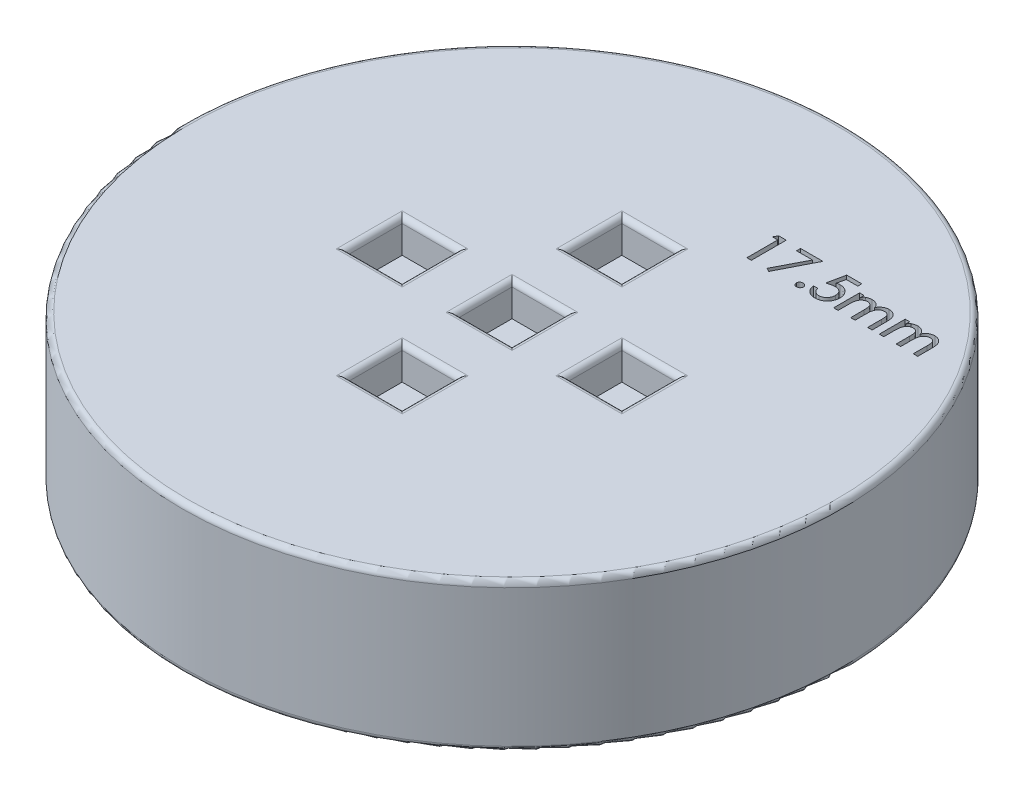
from build123d import *

# Parameters (mm, degrees)
SKETCH1_R           = 30
BOSS_EXTRUDE1_DEPTH = 13.5
SKETCH2_W           = 5
SKETCH2_H           = 5
CUT_EXTRUDE1_DEPTH  = 3
FILLET1_R           = 0.5
SKETCH4_W           = 5
SKETCH4_H           = 5
CUT_EXTRUDE2_DEPTH  = 3
FILLET2_R           = 0.5
FILLET3_R           = 0.5
CUT_EXTRUDE3_DEPTH  = 2


with BuildPart() as part:
    # Sketch1 → Boss-Extrude1 (new body)
    with BuildSketch(Plane(origin=(0, 0, 0), x_dir=(1, 0, 0), z_dir=(0, 1, 0))):
        with Locations(Location((0, 0, 0), (0, 0, 270))):
            Circle(SKETCH1_R)
    extrude(amount=BOSS_EXTRUDE1_DEPTH)

    # Sketch2 → Cut-Extrude1 (cut)
    with BuildSketch(Plane(origin=(0, 13.5, 0), x_dir=(1, 0, 0), z_dir=(0, 1, 0))):
        with Locations((0, -10)):
            Rectangle(SKETCH2_W, SKETCH2_H)
        with Locations((-10, 0)):
            Rectangle(SKETCH2_W, SKETCH2_H)
        Rectangle(SKETCH2_W, SKETCH2_H)
        with Locations((0, 10)):
            Rectangle(SKETCH2_W, SKETCH2_H)
        with Locations((10, 0)):
            Rectangle(SKETCH2_W, SKETCH2_H)
    extrude(amount=-CUT_EXTRUDE1_DEPTH, mode=Mode.SUBTRACT)

    # Fillet1
    fillet1_edges = [part.edges().sort_by_distance(p)[0] for p in [
        (2.5, 13.5, 0),
        (0, 13.5, 2.5),
        (-12.5, 13.5, 0),
        (-10, 13.5, 2.5),
        (-7.5, 13.5, 0),
        (-10, 13.5, -2.5),
    ]]
    fillet(fillet1_edges, radius=FILLET1_R)

    # Sketch4 → Cut-Extrude2 (cut)
    with BuildSketch(Plane(origin=(0, 0, 0), x_dir=(-1, 0, 0), z_dir=(0, -1, 0))):
        Rectangle(SKETCH4_W, SKETCH4_H)
        with Locations((0, -10)):
            Rectangle(SKETCH4_W, SKETCH4_H)
        with Locations((10, 0)):
            Rectangle(SKETCH4_W, SKETCH4_H)
        with Locations((-10, 0)):
            Rectangle(SKETCH4_W, SKETCH4_H)
        with Locations((0, 10)):
            Rectangle(SKETCH4_W, SKETCH4_H)
    extrude(amount=-CUT_EXTRUDE2_DEPTH, mode=Mode.SUBTRACT)

    # Fillet2
    fillet2_edges = [part.edges().sort_by_distance(p)[0] for p in [
        (-2.5, 0, 0),
        (0, 0, -2.5),
        (2.5, 0, 0),
        (0, 0, 2.5),
        (-2.5, 0, 10),
        (0, 0, 7.5),
        (2.5, 0, 10),
        (0, 0, 12.5),
        (-12.5, 0, 0),
        (-10, 0, -2.5),
        (-7.5, 0, 0),
        (-10, 0, 2.5),
        (7.5, 0, 0),
        (10, 0, -2.5),
        (12.5, 0, 0),
        (10, 0, 2.5),
        (2.5, 0, -10),
        (0, 0, -7.5),
        (-2.5, 0, -10),
        (0, 0, -12.5),
        (0, 0, -30),
    ]]
    fillet(fillet2_edges, radius=FILLET2_R)

    # Fillet3
    fillet3_edges = [part.edges().sort_by_distance(p)[0] for p in [
        (0, 13.5, -30),
        (0, 13.5, 7.5),
        (-2.5, 13.5, 10),
        (0, 13.5, 12.5),
        (2.5, 13.5, 10),
        (-2.5, 13.5, 0.25),
        (0.25, 13.5, -2.5),
        (0, 13.5, -12.5),
        (-2.5, 13.5, -10),
        (0, 13.5, -7.5),
        (2.5, 13.5, -10),
        (10, 13.5, 2.5),
        (12.5, 13.5, 0),
        (10, 13.5, -2.5),
        (7.5, 13.5, 0),
    ]]
    fillet(fillet3_edges, radius=FILLET3_R)

    # Sketch5 → Cut-Extrude3 (cut)
    with BuildSketch(Plane(origin=(0, 13.5, 0), x_dir=(1, 0, 0), z_dir=(0, 1, 0))):
        Polygon((6.099448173, 18.173639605), (6.790163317, 18.173639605), (6.790163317, 14.998639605), (6.383112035, 14.998639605), (6.383112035, 17.807293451), (5.894650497, 17.807293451), align=None)
        Polygon((8.09272742, 18.173639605), (10.12798383, 18.173639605), (8.462889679, 14.917229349), (8.132160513, 15.075597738), (9.545391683, 17.807293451), (8.09272742, 17.807293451), align=None)
        with BuildLine():
            add(Edge.make_bspline(
                [(10.92173383, 15.5685114), (10.946446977, 15.567565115), (10.994036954, 15.565742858), (11.061612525, 15.547447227), (11.121793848, 15.517056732), (11.172232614, 15.474830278), (11.214524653, 15.427202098), (11.244554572, 15.374931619), (11.264889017, 15.320231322), (11.266779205, 15.28226752), (11.26772742, 15.263222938)],
                knots=[0, 0, 0, 0, 1.15701891, 2.228065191, 3.255424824, 4.294461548, 5.295444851, 6.226722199, 7.110433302, 8, 8, 8, 8], degree=3))
            add(Edge.make_bspline(
                [(11.26772742, 15.263222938), (11.266693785, 15.244416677), (11.264625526, 15.206786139), (11.245402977, 15.151996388), (11.21490795, 15.099844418), (11.173097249, 15.051675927), (11.122577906, 15.009243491), (11.061790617, 14.9798333), (10.994361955, 14.960520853), (10.94646884, 14.958815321), (10.92173383, 14.957934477)],
                knots=[0, 0, 0, 0, 0.879435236, 1.759712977, 2.690738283, 3.698978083, 4.737733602, 5.760330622, 6.843294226, 8, 8, 8, 8], degree=3))
            add(Edge.make_bspline(
                [(10.92173383, 14.957934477), (10.901271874, 14.959043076), (10.861133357, 14.961217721), (10.803311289, 14.978178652), (10.750852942, 15.007089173), (10.704117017, 15.045591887), (10.665379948, 15.092442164), (10.636995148, 15.145144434), (10.619614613, 15.202790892), (10.617519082, 15.242749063), (10.616445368, 15.263222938)],
                knots=[0, 0, 0, 0, 1.022542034, 2.005835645, 2.98339371, 4.000421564, 5.017449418, 6.004339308, 6.977457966, 8, 8, 8, 8], degree=3))
            add(Edge.make_bspline(
                [(10.616445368, 15.263222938), (10.617533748, 15.283901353), (10.619658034, 15.32426124), (10.63672122, 15.382255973), (10.665403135, 15.434692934), (10.704337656, 15.480855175), (10.750924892, 15.519600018), (10.803662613, 15.547955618), (10.861299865, 15.565343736), (10.901259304, 15.567438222), (10.92173383, 15.5685114)],
                knots=[0, 0, 0, 0, 1.03279153, 2.015790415, 2.993055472, 4.001620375, 5.018343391, 6.004937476, 6.977764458, 8, 8, 8, 8], degree=3))
        make_face()
        with BuildLine():
            Line((13.669329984, 18.173639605), (13.669329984, 17.807293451))
            Line((13.669329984, 17.807293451), (12.626261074, 17.807293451))
            Line((12.626261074, 17.807293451), (12.455808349, 17.054884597))
            add(Edge.make_bspline(
                [(12.455808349, 17.054884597), (12.475693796, 17.064468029), (12.516618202, 17.084190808), (12.585037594, 17.101375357), (12.659321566, 17.113466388), (12.711217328, 17.114676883), (12.738200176, 17.115306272)],
                knots=[0, 0, 0, 0, 0.906577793, 1.865744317, 2.890308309, 4, 4, 4, 4], degree=3))
            add(Edge.make_bspline(
                [(12.738200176, 17.115306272), (12.776416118, 17.114606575), (12.851446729, 17.113232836), (12.960797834, 17.097881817), (13.064999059, 17.074883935), (13.163193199, 17.040575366), (13.256501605, 16.998339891), (13.343911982, 16.945488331), (13.425333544, 16.88291722), (13.500657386, 16.811691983), (13.56930848, 16.734110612), (13.628270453, 16.650330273), (13.679380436, 16.56279847), (13.719892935, 16.470002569), (13.751902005, 16.372902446), (13.77466605, 16.271092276), (13.789137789, 16.164877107), (13.790669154, 16.092425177), (13.791445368, 16.055700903)],
                knots=[0, 0, 0, 0, 1.094894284, 2.149641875, 3.159658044, 4.149576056, 5.125966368, 6.091225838, 7.071072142, 8.064343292, 9.05924964, 10.03573454, 10.996966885, 11.96032995, 12.932910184, 13.923798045, 14.947619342, 16, 16, 16, 16], degree=3))
            add(Edge.make_bspline(
                [(13.791445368, 16.055700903), (13.790848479, 16.030038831), (13.789667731, 15.979274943), (13.783514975, 15.90379233), (13.771770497, 15.829937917), (13.756176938, 15.757141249), (13.734690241, 15.686026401), (13.710230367, 15.61564793), (13.68017946, 15.547127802), (13.645871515, 15.480494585), (13.607807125, 15.416235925), (13.565896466, 15.355131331), (13.520043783, 15.297669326), (13.470086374, 15.24433086), (13.417389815, 15.193744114), (13.360579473, 15.147229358), (13.299816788, 15.104591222), (13.235968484, 15.06536361), (13.169065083, 15.029924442), (13.098713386, 15.00058153), (13.026659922, 14.973920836), (12.951122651, 14.953958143), (12.873525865, 14.937160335), (12.792938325, 14.926012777), (12.709924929, 14.918744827), (12.65362574, 14.917740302), (12.624989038, 14.917229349)],
                knots=[0, 0, 0, 0, 1.012275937, 2.002451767, 2.98397589, 3.959820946, 4.936095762, 5.911940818, 6.896771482, 7.884012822, 8.866284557, 9.840372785, 10.804070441, 11.762530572, 12.720625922, 13.68308951, 14.655094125, 15.646011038, 16.637104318, 17.63729087, 18.650257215, 19.66446511, 20.715636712, 21.77986274, 22.870722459, 24, 24, 24, 24], degree=3))
            add(Edge.make_bspline(
                [(12.624989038, 14.917229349), (12.592735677, 14.918003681), (12.529106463, 14.91953128), (12.435653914, 14.930366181), (12.346001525, 14.948749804), (12.260529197, 14.975065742), (12.178601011, 15.008073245), (12.100915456, 15.048905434), (12.027170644, 15.097195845), (11.957271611, 15.152023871), (11.893520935, 15.214568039), (11.834756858, 15.281898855), (11.784689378, 15.356495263), (11.740645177, 15.436298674), (11.702801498, 15.521958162), (11.672694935, 15.613636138), (11.648621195, 15.710985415), (11.63899918, 15.778288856), (11.634073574, 15.812742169)],
                knots=[0, 0, 0, 0, 1.049569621, 2.070583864, 3.057046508, 4.023914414, 4.977170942, 5.927726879, 6.875021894, 7.842677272, 8.813672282, 9.777581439, 10.74592533, 11.731059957, 12.74126976, 13.788569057, 14.867946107, 16, 16, 16, 16], degree=3))
            Line((11.634073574, 15.812742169), (12.031584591, 15.812742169))
            add(Edge.make_bspline(
                [(12.031584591, 15.812742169), (12.039150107, 15.779468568), (12.053352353, 15.71700622), (12.083862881, 15.631897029), (12.116563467, 15.559510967), (12.156559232, 15.500311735), (12.202464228, 15.451718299), (12.253415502, 15.409537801), (12.309391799, 15.371700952), (12.371015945, 15.340293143), (12.435943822, 15.314847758), (12.50340608, 15.297088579), (12.572040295, 15.285921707), (12.61837541, 15.284357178), (12.641525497, 15.283575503)],
                knots=[0, 0, 0, 0, 1.385459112, 2.600831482, 3.66841355, 4.605180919, 5.48910649, 6.376050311, 7.288896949, 8.229144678, 9.181161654, 10.117453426, 11.059436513, 12, 12, 12, 12], degree=3))
            add(Edge.make_bspline(
                [(12.641525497, 15.283575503), (12.666568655, 15.284416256), (12.716011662, 15.286076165), (12.788849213, 15.296013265), (12.858508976, 15.314394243), (12.925996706, 15.338219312), (12.990133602, 15.370670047), (13.052493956, 15.408560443), (13.110803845, 15.455088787), (13.166692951, 15.506822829), (13.217881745, 15.564126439), (13.262454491, 15.626040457), (13.300476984, 15.691321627), (13.330777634, 15.760404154), (13.355369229, 15.832655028), (13.372272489, 15.908567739), (13.382818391, 15.987983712), (13.383861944, 16.042098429), (13.384394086, 16.069693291)],
                knots=[0, 0, 0, 0, 0.99750234, 1.969380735, 2.919490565, 3.862219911, 4.813679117, 5.776605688, 6.762898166, 7.778387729, 8.806918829, 9.816812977, 10.811632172, 11.809420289, 12.815921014, 13.846113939, 14.901663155, 16, 16, 16, 16], degree=3))
            add(Edge.make_bspline(
                [(13.384394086, 16.069693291), (13.383761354, 16.094314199), (13.382518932, 16.142659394), (13.373417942, 16.213317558), (13.358981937, 16.280716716), (13.338005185, 16.34422327), (13.311040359, 16.404188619), (13.27788197, 16.460229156), (13.238631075, 16.512656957), (13.194489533, 16.561641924), (13.144520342, 16.605410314), (13.090868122, 16.644582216), (13.031903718, 16.676263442), (12.969753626, 16.703374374), (12.90298025, 16.723188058), (12.832779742, 16.739153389), (12.757873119, 16.746823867), (12.706623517, 16.748235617), (12.680322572, 16.748960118)],
                knots=[0, 0, 0, 0, 1.071512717, 2.104004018, 3.095982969, 4.067795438, 5.009520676, 5.952827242, 6.895998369, 7.856350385, 8.817411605, 9.782937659, 10.74115891, 11.725120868, 12.729302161, 13.768330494, 14.854722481, 16, 16, 16, 16], degree=3))
            add(Edge.make_bspline(
                [(12.680322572, 16.748960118), (12.657831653, 16.748420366), (12.610614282, 16.747287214), (12.536727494, 16.739093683), (12.456324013, 16.726206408), (12.36953098, 16.7083826), (12.276264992, 16.685161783), (12.176412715, 16.657023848), (12.069863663, 16.624190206), (11.997167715, 16.59907765), (11.959714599, 16.586139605)],
                knots=[0, 0, 0, 0, 0.727614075, 1.527550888, 2.402655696, 3.361819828, 4.39328773, 5.511706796, 6.718025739, 8, 8, 8, 8], degree=3))
            Line((11.959714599, 16.586139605), (12.292987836, 18.173639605))
            Line((12.292987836, 18.173639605), (13.669329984, 18.173639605))
        make_face()
        with BuildLine():
            Line((14.279906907, 17.359537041), (14.686958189, 17.359537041))
            Line((14.686958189, 17.359537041), (14.686958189, 16.963298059))
            add(Edge.make_bspline(
                [(14.686958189, 16.963298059), (14.690867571, 16.980348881), (14.698495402, 17.013617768), (14.715292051, 17.061093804), (14.735811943, 17.104995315), (14.759166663, 17.146371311), (14.787546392, 17.183616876), (14.818589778, 17.218617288), (14.854529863, 17.249026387), (14.880567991, 17.266695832), (14.893663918, 17.275582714)],
                knots=[0, 0, 0, 0, 1.08898891, 2.124791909, 3.129224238, 4.105481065, 5.077441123, 6.040388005, 7.014409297, 8, 8, 8, 8], degree=3))
            add(Edge.make_bspline(
                [(14.893663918, 17.275582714), (14.933082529, 17.294892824), (15.010913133, 17.333019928), (15.134010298, 17.37089318), (15.258549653, 17.396126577), (15.342568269, 17.398868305), (15.384669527, 17.400242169)],
                knots=[0, 0, 0, 0, 1.028471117, 2.030678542, 3.013184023, 4, 4, 4, 4], degree=3))
            add(Edge.make_bspline(
                [(15.384669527, 17.400242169), (15.41567654, 17.399452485), (15.477165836, 17.39788648), (15.568212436, 17.383286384), (15.656637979, 17.35981737), (15.741608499, 17.327426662), (15.820877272, 17.287683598), (15.893251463, 17.242775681), (15.956958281, 17.191866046), (16.012816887, 17.136124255), (16.059231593, 17.073629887), (16.095832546, 17.005198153), (16.121798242, 16.929976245), (16.1306343, 16.877186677), (16.135170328, 16.850086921)],
                knots=[0, 0, 0, 0, 1.099015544, 2.179432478, 3.260947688, 4.338981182, 5.398181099, 6.40160478, 7.353922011, 8.284349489, 9.192639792, 10.104191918, 11.026778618, 12, 12, 12, 12], degree=3))
            add(Edge.make_bspline(
                [(16.135170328, 16.850086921), (16.142517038, 16.870971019), (16.157044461, 16.912267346), (16.183609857, 16.971761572), (16.215790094, 17.027292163), (16.252181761, 17.079601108), (16.292793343, 17.12901041), (16.339073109, 17.173800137), (16.388649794, 17.216469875), (16.44332119, 17.253873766), (16.500189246, 17.288185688), (16.558867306, 17.318098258), (16.618471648, 17.343734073), (16.679482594, 17.363878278), (16.741116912, 17.380832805), (16.804327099, 17.39223649), (16.868585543, 17.398445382), (16.911735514, 17.399642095), (16.933372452, 17.400242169)],
                knots=[0, 0, 0, 0, 1.024672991, 2.026193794, 3.01103273, 3.991165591, 4.973850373, 5.96628909, 6.969107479, 7.9982829, 9.028393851, 10.042340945, 11.044967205, 12.028827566, 13.014448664, 14.002022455, 14.998142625, 16, 16, 16, 16], degree=3))
            add(Edge.make_bspline(
                [(16.933372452, 17.400242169), (16.955439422, 17.399953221), (16.998821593, 17.399385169), (17.062739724, 17.392585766), (17.124649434, 17.382675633), (17.184456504, 17.36811763), (17.24194445, 17.348781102), (17.297389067, 17.325810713), (17.351063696, 17.299342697), (17.418170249, 17.257592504), (17.496398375, 17.19933431), (17.575773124, 17.115223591), (17.642297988, 17.021504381), (17.685520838, 16.934174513), (17.713059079, 16.857537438), (17.731562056, 16.793208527), (17.746432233, 16.722357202), (17.75930218, 16.645366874), (17.768529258, 16.561688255), (17.775358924, 16.471745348), (17.780068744, 16.375243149), (17.780384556, 16.308841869), (17.780547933, 16.274490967)],
                knots=[0, 0, 0, 0, 0.823429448, 1.618806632, 2.396867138, 3.162757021, 3.913573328, 4.658737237, 5.40200746, 6.144476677, 7.607081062, 9.028926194, 10.443018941, 11.88355177, 12.649646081, 13.481287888, 14.380074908, 15.350698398, 16.394246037, 17.521443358, 18.717785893, 20, 20, 20, 20], degree=3))
            Line((17.780547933, 16.274490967), (17.780547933, 14.998639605))
            Line((17.780547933, 14.998639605), (17.373496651, 14.998639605))
            Line((17.373496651, 14.998639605), (17.373496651, 16.273218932))
            add(Edge.make_bspline(
                [(17.373496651, 16.273218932), (17.373445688, 16.30163016), (17.373347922, 16.356133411), (17.370661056, 16.434166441), (17.366886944, 16.504992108), (17.362127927, 16.568676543), (17.355095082, 16.625312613), (17.346887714, 16.674969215), (17.337935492, 16.71769164), (17.322513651, 16.764395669), (17.298418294, 16.815446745), (17.260777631, 16.869970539), (17.21451172, 16.917964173), (17.160213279, 16.959199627), (17.099280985, 16.993410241), (17.031328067, 17.016483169), (16.958237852, 17.031927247), (16.907380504, 17.033227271), (16.881219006, 17.033896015)],
                knots=[0, 0, 0, 0, 1.305376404, 2.504195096, 3.587062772, 4.564309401, 5.437885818, 6.208191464, 6.877018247, 7.440755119, 8.464755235, 9.459136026, 10.471907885, 11.51427718, 12.582498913, 13.666986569, 14.799875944, 16, 16, 16, 16], degree=3))
            add(Edge.make_bspline(
                [(16.881219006, 17.033896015), (16.852069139, 17.032474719), (16.793700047, 17.029628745), (16.707496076, 17.008794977), (16.624739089, 16.972779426), (16.54530401, 16.924762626), (16.472378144, 16.863697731), (16.407784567, 16.791113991), (16.354492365, 16.706252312), (16.316858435, 16.62737726), (16.292562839, 16.55525698), (16.277222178, 16.491317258), (16.262909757, 16.418834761), (16.252877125, 16.337168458), (16.243470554, 16.246674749), (16.238535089, 16.147113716), (16.23431649, 16.038564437), (16.233946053, 15.963271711), (16.233753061, 15.924045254)],
                knots=[0, 0, 0, 0, 0.96585306, 1.934004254, 2.919496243, 3.947541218, 5.000269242, 6.060662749, 7.154254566, 8.311133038, 8.948925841, 9.673294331, 10.489200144, 11.396606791, 12.399336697, 13.504450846, 14.699853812, 16, 16, 16, 16], degree=3))
            Line((16.233753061, 15.924045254), (16.233753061, 14.998639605))
            Line((16.233753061, 14.998639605), (15.826701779, 14.998639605))
            Line((15.826701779, 14.998639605), (15.826701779, 16.196260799))
            add(Edge.make_bspline(
                [(15.826701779, 16.196260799), (15.826652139, 16.228275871), (15.826557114, 16.289561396), (15.823863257, 16.377344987), (15.820075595, 16.457071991), (15.815384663, 16.528596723), (15.808350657, 16.591807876), (15.80006821, 16.64674578), (15.791248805, 16.693716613), (15.775855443, 16.744329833), (15.752322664, 16.799795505), (15.714540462, 16.858563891), (15.667975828, 16.910393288), (15.613028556, 16.954113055), (15.551447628, 16.989919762), (15.48357842, 17.015549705), (15.410187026, 17.031205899), (15.359308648, 17.032982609), (15.333152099, 17.033896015)],
                knots=[0, 0, 0, 0, 1.376972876, 2.63589934, 3.777064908, 4.810071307, 5.718390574, 6.511518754, 7.200035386, 7.771255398, 8.78422519, 9.780850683, 10.762300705, 11.767731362, 12.789080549, 13.813681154, 14.876014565, 16, 16, 16, 16], degree=3))
            add(Edge.make_bspline(
                [(15.333152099, 17.033896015), (15.305275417, 17.032425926), (15.249265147, 17.029472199), (15.166178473, 17.009148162), (15.085152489, 16.974363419), (15.006342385, 16.927787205), (14.932379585, 16.868954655), (14.867365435, 16.797076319), (14.811993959, 16.713595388), (14.773705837, 16.63518713), (14.748532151, 16.564787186), (14.732450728, 16.504050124), (14.717527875, 16.436676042), (14.706541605, 16.362040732), (14.697656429, 16.280572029), (14.691467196, 16.192099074), (14.687620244, 16.096652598), (14.687183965, 16.030688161), (14.686958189, 15.996551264)],
                knots=[0, 0, 0, 0, 0.973948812, 1.956873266, 2.969584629, 4.045778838, 5.147278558, 6.259119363, 7.418022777, 8.637370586, 9.298195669, 10.027900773, 10.831491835, 11.708502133, 12.662464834, 13.694928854, 14.807115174, 16, 16, 16, 16], degree=3))
            Line((14.686958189, 15.996551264), (14.686958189, 14.998639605))
            Line((14.686958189, 14.998639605), (14.279906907, 14.998639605))
            Line((14.279906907, 14.998639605), (14.279906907, 17.359537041))
        make_face()
        with BuildLine():
            Line((18.431829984, 17.359537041), (18.838881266, 17.359537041))
            Line((18.838881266, 17.359537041), (18.838881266, 16.963298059))
            add(Edge.make_bspline(
                [(18.838881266, 16.963298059), (18.842790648, 16.980348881), (18.850418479, 17.013617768), (18.867215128, 17.061093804), (18.88773502, 17.104995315), (18.91108974, 17.146371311), (18.939469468, 17.183616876), (18.970512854, 17.218617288), (19.00645294, 17.249026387), (19.032491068, 17.266695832), (19.045586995, 17.275582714)],
                knots=[0, 0, 0, 0, 1.08898891, 2.124791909, 3.129224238, 4.105481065, 5.077441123, 6.040388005, 7.014409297, 8, 8, 8, 8], degree=3))
            add(Edge.make_bspline(
                [(19.045586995, 17.275582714), (19.085005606, 17.294892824), (19.16283621, 17.333019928), (19.285933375, 17.37089318), (19.41047273, 17.396126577), (19.494491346, 17.398868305), (19.536592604, 17.400242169)],
                knots=[0, 0, 0, 0, 1.028471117, 2.030678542, 3.013184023, 4, 4, 4, 4], degree=3))
            add(Edge.make_bspline(
                [(19.536592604, 17.400242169), (19.567599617, 17.399452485), (19.629088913, 17.39788648), (19.720135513, 17.383286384), (19.808561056, 17.35981737), (19.893531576, 17.327426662), (19.972800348, 17.287683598), (20.04517454, 17.242775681), (20.108881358, 17.191866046), (20.164739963, 17.136124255), (20.21115467, 17.073629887), (20.247755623, 17.005198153), (20.273721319, 16.929976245), (20.282557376, 16.877186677), (20.287093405, 16.850086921)],
                knots=[0, 0, 0, 0, 1.099015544, 2.179432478, 3.260947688, 4.338981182, 5.398181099, 6.40160478, 7.353922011, 8.284349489, 9.192639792, 10.104191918, 11.026778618, 12, 12, 12, 12], degree=3))
            add(Edge.make_bspline(
                [(20.287093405, 16.850086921), (20.294440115, 16.870971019), (20.308967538, 16.912267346), (20.335532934, 16.971761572), (20.367713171, 17.027292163), (20.404104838, 17.079601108), (20.44471642, 17.12901041), (20.490996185, 17.173800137), (20.54057287, 17.216469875), (20.595244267, 17.253873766), (20.652112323, 17.288185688), (20.710790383, 17.318098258), (20.770394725, 17.343734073), (20.831405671, 17.363878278), (20.893039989, 17.380832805), (20.956250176, 17.39223649), (21.02050862, 17.398445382), (21.063658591, 17.399642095), (21.085295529, 17.400242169)],
                knots=[0, 0, 0, 0, 1.024672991, 2.026193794, 3.01103273, 3.991165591, 4.973850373, 5.96628909, 6.969107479, 7.9982829, 9.028393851, 10.042340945, 11.044967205, 12.028827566, 13.014448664, 14.002022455, 14.998142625, 16, 16, 16, 16], degree=3))
            add(Edge.make_bspline(
                [(21.085295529, 17.400242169), (21.107362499, 17.399953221), (21.15074467, 17.399385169), (21.214662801, 17.392585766), (21.276572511, 17.382675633), (21.336379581, 17.36811763), (21.393867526, 17.348781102), (21.449312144, 17.325810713), (21.502986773, 17.299342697), (21.570093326, 17.257592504), (21.648321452, 17.19933431), (21.727696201, 17.115223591), (21.794221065, 17.021504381), (21.837443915, 16.934174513), (21.864982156, 16.857537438), (21.883485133, 16.793208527), (21.89835531, 16.722357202), (21.911225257, 16.645366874), (21.920452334, 16.561688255), (21.927282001, 16.471745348), (21.931991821, 16.375243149), (21.932307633, 16.308841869), (21.93247101, 16.274490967)],
                knots=[0, 0, 0, 0, 0.823429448, 1.618806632, 2.396867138, 3.162757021, 3.913573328, 4.658737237, 5.40200746, 6.144476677, 7.607081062, 9.028926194, 10.443018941, 11.88355177, 12.649646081, 13.481287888, 14.380074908, 15.350698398, 16.394246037, 17.521443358, 18.717785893, 20, 20, 20, 20], degree=3))
            Line((21.93247101, 16.274490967), (21.93247101, 14.998639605))
            Line((21.93247101, 14.998639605), (21.525419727, 14.998639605))
            Line((21.525419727, 14.998639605), (21.525419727, 16.273218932))
            add(Edge.make_bspline(
                [(21.525419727, 16.273218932), (21.525368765, 16.30163016), (21.525270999, 16.356133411), (21.522584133, 16.434166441), (21.518810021, 16.504992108), (21.514051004, 16.568676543), (21.507018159, 16.625312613), (21.498810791, 16.674969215), (21.489858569, 16.71769164), (21.474436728, 16.764395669), (21.450341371, 16.815446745), (21.412700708, 16.869970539), (21.366434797, 16.917964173), (21.312136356, 16.959199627), (21.251204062, 16.993410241), (21.183251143, 17.016483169), (21.110160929, 17.031927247), (21.059303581, 17.033227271), (21.033142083, 17.033896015)],
                knots=[0, 0, 0, 0, 1.305376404, 2.504195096, 3.587062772, 4.564309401, 5.437885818, 6.208191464, 6.877018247, 7.440755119, 8.464755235, 9.459136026, 10.471907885, 11.51427718, 12.582498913, 13.666986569, 14.799875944, 16, 16, 16, 16], degree=3))
            add(Edge.make_bspline(
                [(21.033142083, 17.033896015), (21.003992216, 17.032474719), (20.945623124, 17.029628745), (20.859419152, 17.008794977), (20.776662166, 16.972779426), (20.697227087, 16.924762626), (20.624301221, 16.863697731), (20.559707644, 16.791113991), (20.506415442, 16.706252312), (20.468781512, 16.62737726), (20.444485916, 16.55525698), (20.429145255, 16.491317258), (20.414832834, 16.418834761), (20.404800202, 16.337168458), (20.395393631, 16.246674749), (20.390458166, 16.147113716), (20.386239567, 16.038564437), (20.38586913, 15.963271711), (20.385676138, 15.924045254)],
                knots=[0, 0, 0, 0, 0.96585306, 1.934004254, 2.919496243, 3.947541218, 5.000269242, 6.060662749, 7.154254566, 8.311133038, 8.948925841, 9.673294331, 10.489200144, 11.396606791, 12.399336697, 13.504450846, 14.699853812, 16, 16, 16, 16], degree=3))
            Line((20.385676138, 15.924045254), (20.385676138, 14.998639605))
            Line((20.385676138, 14.998639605), (19.978624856, 14.998639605))
            Line((19.978624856, 14.998639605), (19.978624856, 16.196260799))
            add(Edge.make_bspline(
                [(19.978624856, 16.196260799), (19.978575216, 16.228275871), (19.978480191, 16.289561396), (19.975786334, 16.377344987), (19.971998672, 16.457071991), (19.96730774, 16.528596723), (19.960273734, 16.591807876), (19.951991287, 16.64674578), (19.943171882, 16.693716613), (19.92777852, 16.744329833), (19.904245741, 16.799795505), (19.866463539, 16.858563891), (19.819898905, 16.910393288), (19.764951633, 16.954113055), (19.703370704, 16.989919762), (19.635501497, 17.015549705), (19.562110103, 17.031205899), (19.511231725, 17.032982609), (19.485075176, 17.033896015)],
                knots=[0, 0, 0, 0, 1.376972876, 2.63589934, 3.777064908, 4.810071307, 5.718390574, 6.511518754, 7.200035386, 7.771255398, 8.78422519, 9.780850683, 10.762300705, 11.767731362, 12.789080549, 13.813681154, 14.876014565, 16, 16, 16, 16], degree=3))
            add(Edge.make_bspline(
                [(19.485075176, 17.033896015), (19.457198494, 17.032425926), (19.401188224, 17.029472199), (19.31810155, 17.009148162), (19.237075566, 16.974363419), (19.158265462, 16.927787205), (19.084302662, 16.868954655), (19.019288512, 16.797076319), (18.963917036, 16.713595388), (18.925628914, 16.63518713), (18.900455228, 16.564787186), (18.884373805, 16.504050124), (18.869450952, 16.436676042), (18.858464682, 16.362040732), (18.849579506, 16.280572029), (18.843390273, 16.192099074), (18.839543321, 16.096652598), (18.839107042, 16.030688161), (18.838881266, 15.996551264)],
                knots=[0, 0, 0, 0, 0.973948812, 1.956873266, 2.969584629, 4.045778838, 5.147278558, 6.259119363, 7.418022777, 8.637370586, 9.298195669, 10.027900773, 10.831491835, 11.708502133, 12.662464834, 13.694928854, 14.807115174, 16, 16, 16, 16], degree=3))
            Line((18.838881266, 15.996551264), (18.838881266, 14.998639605))
            Line((18.838881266, 14.998639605), (18.431829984, 14.998639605))
            Line((18.431829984, 14.998639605), (18.431829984, 17.359537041))
        make_face()
    extrude(amount=-CUT_EXTRUDE3_DEPTH, mode=Mode.SUBTRACT)


solid = part.part
